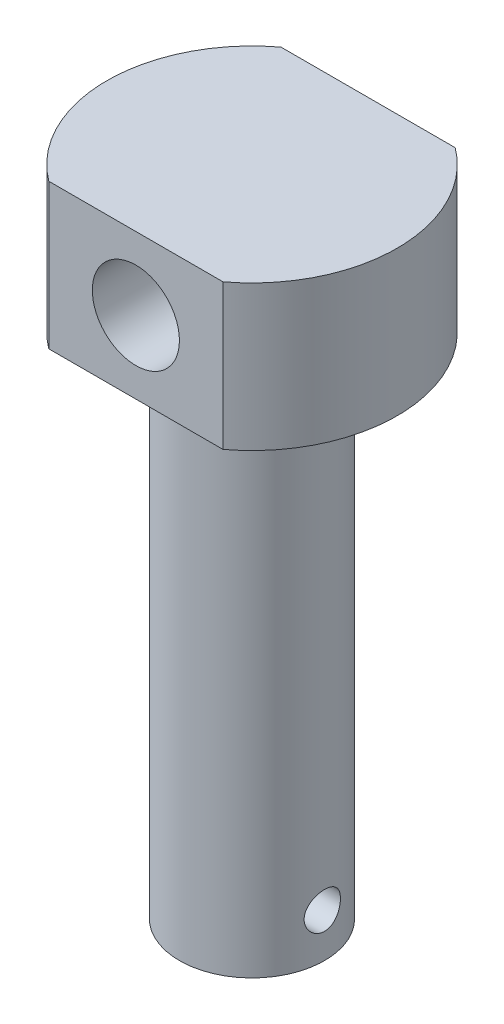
from build123d import *

# Parameters (mm, degrees)
ESQUISSE2_W                       = 12
ESQUISSE2_H                       = 6.672530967
EXTRUSION1_DEPTH                  = 48.16990566
DIAM_TRE_DU_PER_AGE_6_0_6_1_D     = 6
DIAM_TRE_DU_PER_AGE_3_0_3_1_D     = 3
DIAM_TRE_DU_PER_AGE_3_0_3_1_DEPTH = 10
DIAM_TRE_DU_PER_AGE_3_0_3_1_TIP   = 0.901290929
ESQUISSE7_W                       = 1.25
ESQUISSE7_H                       = 10


with BuildPart() as part:
    # Esquisse1 → R_volution1 (revolve)
    with BuildSketch(Plane.XY, mode=Mode.PRIVATE) as r_volution1_sk:
        Polygon((0, 0), (5, 0), (5, 35), (10, 35), (10, 45), (0, 45), align=None)
    revolve(r_volution1_sk.sketch.rotate(Axis((0, 103.551163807, 0), (0, -1, 0)), 180), axis=Axis((0, 103.551163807, 0), (0, -1, 0)))

    # Esquisse2 → Extrusion1 (cut, through all)
    with BuildSketch(Plane(origin=(0, 45, 0), x_dir=(1, 0, 0), z_dir=(0, 1, 0))):
        with Locations((0, 11.336265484)):
            Rectangle(ESQUISSE2_W, ESQUISSE2_H)
        with Locations((0, -11.336265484)):
            Rectangle(ESQUISSE2_W, ESQUISSE2_H)
    extrude(amount=-EXTRUSION1_DEPTH, mode=Mode.SUBTRACT)

    # Diam_tre du per_age _6.0 _6_1 (through all)
    with Locations(Plane.XY.offset(8)):
        with Locations((0, 40)):
            Hole(DIAM_TRE_DU_PER_AGE_6_0_6_1_D / 2)

    # Diam_tre du per_age _3.0 _3_1
    with Locations(Plane.XZ):
        with Locations((0, 0)):
            Hole(DIAM_TRE_DU_PER_AGE_3_0_3_1_D / 2, depth=DIAM_TRE_DU_PER_AGE_3_0_3_1_DEPTH)
            with Locations((0, 0, -(DIAM_TRE_DU_PER_AGE_3_0_3_1_DEPTH + DIAM_TRE_DU_PER_AGE_3_0_3_1_TIP / 2))):  # 118° drill point
                Cone(0, DIAM_TRE_DU_PER_AGE_3_0_3_1_D / 2, DIAM_TRE_DU_PER_AGE_3_0_3_1_TIP, mode=Mode.SUBTRACT)

    # Esquisse7 → Trou taraud_ M31 (revolve, cut)
    with BuildSketch(Plane.ZX.offset(3)):
        with Locations((0.625, 5)):
            Rectangle(ESQUISSE7_W, ESQUISSE7_H)
    revolve(axis=Axis((-6.35, 3, 0), (1, 0, 0)), mode=Mode.SUBTRACT)


solid = part.part
